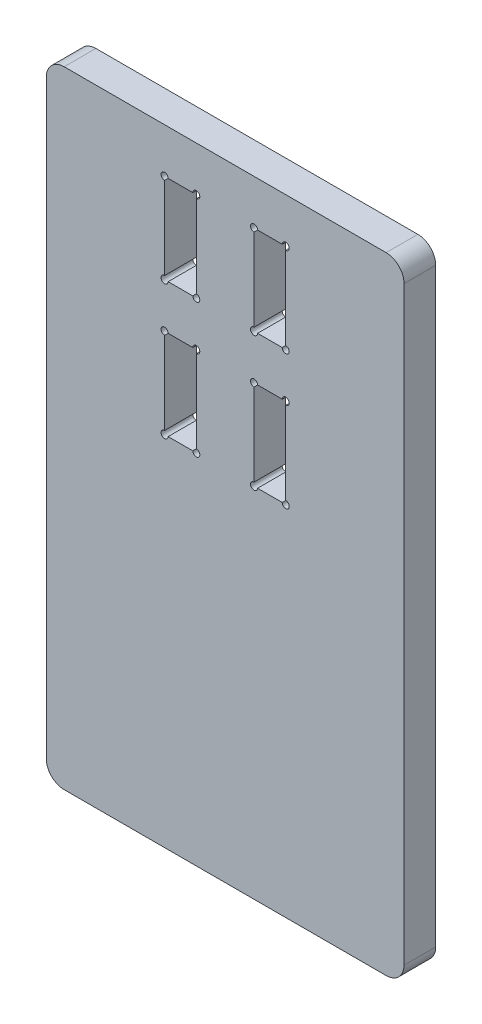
ISO-10303-21;
HEADER;
FILE_DESCRIPTION(('STEP AP214'),'2;1');
FILE_NAME('part.step','',(''),(''),'','','');
FILE_SCHEMA(('AUTOMOTIVE_DESIGN { 1 0 10303 214 1 1 1 1 }'));
ENDSEC;
DATA;
#1=APPLICATION_CONTEXT('core data for automotive mechanical design processes');
#2=APPLICATION_PROTOCOL_DEFINITION('international standard','automotive_design',2000,#1);
#3=PRODUCT_CONTEXT('',#1,'mechanical');
#4=PRODUCT('Part','Part','',(#3));
#5=PRODUCT_RELATED_PRODUCT_CATEGORY('part','',(#4));
#6=PRODUCT_DEFINITION_FORMATION('','',#4);
#7=PRODUCT_DEFINITION_CONTEXT('part definition',#1,'design');
#8=PRODUCT_DEFINITION('design','',#6,#7);
#9=PRODUCT_DEFINITION_SHAPE('','',#8);
#10=(LENGTH_UNIT() NAMED_UNIT(*) SI_UNIT(.MILLI.,.METRE.));
#11=(NAMED_UNIT(*) PLANE_ANGLE_UNIT() SI_UNIT($,.RADIAN.));
#12=(NAMED_UNIT(*) SI_UNIT($,.STERADIAN.) SOLID_ANGLE_UNIT());
#13=UNCERTAINTY_MEASURE_WITH_UNIT(LENGTH_MEASURE(1.E-05),#10,'distance_accuracy_value','');
#14=(GEOMETRIC_REPRESENTATION_CONTEXT(3) GLOBAL_UNCERTAINTY_ASSIGNED_CONTEXT((#13)) GLOBAL_UNIT_ASSIGNED_CONTEXT((#10,
#11,#12)) REPRESENTATION_CONTEXT('',''));
#15=CARTESIAN_POINT('',(0.,0.,0.));
#16=DIRECTION('',(0.,0.,1.));
#17=DIRECTION('',(1.,0.,0.));
#18=AXIS2_PLACEMENT_3D('',#15,#16,#17);
#19=CARTESIAN_POINT('',(0.,82.5500000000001,4.5));
#20=DIRECTION('',(0.,-1.,0.));
#21=DIRECTION('',(0.,0.,-1.));
#22=AXIS2_PLACEMENT_3D('',#19,#20,#21);
#23=PLANE('',#22);
#24=DIRECTION('',(-1.,0.,0.));
#25=VECTOR('',#24,1.);
#26=CARTESIAN_POINT('',(0.,82.5500000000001,0.));
#27=LINE('',#26,#25);
#28=CARTESIAN_POINT('',(20.8,82.5500000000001,0.));
#29=VERTEX_POINT('',#28);
#30=CARTESIAN_POINT('',(17.3,82.5500000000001,0.));
#31=VERTEX_POINT('',#30);
#32=EDGE_CURVE('E484',#29,#31,#27,.T.);
#33=ORIENTED_EDGE('',*,*,#32,.F.);
#34=DIRECTION('',(0.,0.,-1.));
#35=VECTOR('',#34,1.);
#36=CARTESIAN_POINT('',(20.8,82.5500000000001,4.5));
#37=LINE('',#36,#35);
#38=CARTESIAN_POINT('',(20.8,82.5500000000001,4.5));
#39=VERTEX_POINT('',#38);
#40=EDGE_CURVE('E524',#39,#29,#37,.T.);
#41=ORIENTED_EDGE('',*,*,#40,.F.);
#42=DIRECTION('',(-1.,0.,0.));
#43=VECTOR('',#42,1.);
#44=CARTESIAN_POINT('',(0.,82.5500000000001,4.5));
#45=LINE('',#44,#43);
#46=CARTESIAN_POINT('',(17.3,82.5500000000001,4.5));
#47=VERTEX_POINT('',#46);
#48=EDGE_CURVE('E384',#39,#47,#45,.T.);
#49=ORIENTED_EDGE('',*,*,#48,.T.);
#50=DIRECTION('',(0.,0.,-1.));
#51=VECTOR('',#50,1.);
#52=CARTESIAN_POINT('',(17.3,82.5500000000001,4.5));
#53=LINE('',#52,#51);
#54=EDGE_CURVE('E507',#47,#31,#53,.T.);
#55=ORIENTED_EDGE('',*,*,#54,.T.);
#56=EDGE_LOOP('',(#33,#41,#49,#55));
#57=FACE_BOUND('',#56,.T.);
#58=ADVANCED_FACE('F35',(#57),#23,.T.);
#59=CARTESIAN_POINT('',(21.3,82.5500000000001,4.5));
#60=DIRECTION('',(0.,0.,-1.));
#61=DIRECTION('',(-1.,0.,0.));
#62=AXIS2_PLACEMENT_3D('',#59,#60,#61);
#63=CYLINDRICAL_SURFACE('',#62,0.500000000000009);
#64=CARTESIAN_POINT('',(21.3,82.5500000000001,0.));
#65=DIRECTION('',(0.,0.,1.));
#66=DIRECTION('',(1.,0.,0.));
#67=AXIS2_PLACEMENT_3D('',#64,#65,#66);
#68=CIRCLE('',#67,0.500000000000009);
#69=CARTESIAN_POINT('',(21.3,82.0500000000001,0.));
#70=VERTEX_POINT('',#69);
#71=EDGE_CURVE('E487',#29,#70,#68,.F.);
#72=ORIENTED_EDGE('',*,*,#71,.T.);
#73=DIRECTION('',(0.,0.,-1.));
#74=VECTOR('',#73,1.);
#75=CARTESIAN_POINT('',(21.3,82.0500000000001,4.5));
#76=LINE('',#75,#74);
#77=CARTESIAN_POINT('',(21.3,82.0500000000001,4.5));
#78=VERTEX_POINT('',#77);
#79=EDGE_CURVE('E521',#78,#70,#76,.T.);
#80=ORIENTED_EDGE('',*,*,#79,.F.);
#81=CARTESIAN_POINT('',(21.3,82.5500000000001,4.5));
#82=DIRECTION('',(0.,0.,1.));
#83=DIRECTION('',(1.,0.,0.));
#84=AXIS2_PLACEMENT_3D('',#81,#82,#83);
#85=CIRCLE('',#84,0.500000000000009);
#86=EDGE_CURVE('E387',#39,#78,#85,.F.);
#87=ORIENTED_EDGE('',*,*,#86,.F.);
#88=ORIENTED_EDGE('',*,*,#40,.T.);
#89=EDGE_LOOP('',(#72,#80,#87,#88));
#90=FACE_BOUND('',#89,.T.);
#91=ADVANCED_FACE('F643',(#90),#63,.F.);
#92=CARTESIAN_POINT('',(21.3,0.,4.5));
#93=DIRECTION('',(1.,0.,0.));
#94=DIRECTION('',(0.,1.,0.));
#95=AXIS2_PLACEMENT_3D('',#92,#93,#94);
#96=PLANE('',#95);
#97=DIRECTION('',(0.,-1.,0.));
#98=VECTOR('',#97,1.);
#99=CARTESIAN_POINT('',(21.3,0.,0.));
#100=LINE('',#99,#98);
#101=CARTESIAN_POINT('',(21.3,70.3500000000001,0.));
#102=VERTEX_POINT('',#101);
#103=EDGE_CURVE('E490',#70,#102,#100,.T.);
#104=ORIENTED_EDGE('',*,*,#103,.T.);
#105=DIRECTION('',(0.,0.,-1.));
#106=VECTOR('',#105,1.);
#107=CARTESIAN_POINT('',(21.3,70.3500000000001,4.5));
#108=LINE('',#107,#106);
#109=CARTESIAN_POINT('',(21.3,70.3500000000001,4.5));
#110=VERTEX_POINT('',#109);
#111=EDGE_CURVE('E519',#110,#102,#108,.T.);
#112=ORIENTED_EDGE('',*,*,#111,.F.);
#113=DIRECTION('',(0.,-1.,0.));
#114=VECTOR('',#113,1.);
#115=CARTESIAN_POINT('',(21.3,0.,4.5));
#116=LINE('',#115,#114);
#117=EDGE_CURVE('E390',#78,#110,#116,.T.);
#118=ORIENTED_EDGE('',*,*,#117,.F.);
#119=ORIENTED_EDGE('',*,*,#79,.T.);
#120=EDGE_LOOP('',(#104,#112,#118,#119));
#121=FACE_BOUND('',#120,.T.);
#122=ADVANCED_FACE('F649',(#121),#96,.F.);
#123=CARTESIAN_POINT('',(21.3,69.8500000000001,4.5));
#124=DIRECTION('',(0.,0.,-1.));
#125=DIRECTION('',(-1.,0.,0.));
#126=AXIS2_PLACEMENT_3D('',#123,#124,#125);
#127=CYLINDRICAL_SURFACE('',#126,0.500000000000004);
#128=CARTESIAN_POINT('',(21.3,69.8500000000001,0.));
#129=DIRECTION('',(0.,0.,1.));
#130=DIRECTION('',(1.,0.,0.));
#131=AXIS2_PLACEMENT_3D('',#128,#129,#130);
#132=CIRCLE('',#131,0.500000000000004);
#133=CARTESIAN_POINT('',(20.8,69.8500000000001,0.));
#134=VERTEX_POINT('',#133);
#135=EDGE_CURVE('E493',#134,#102,#132,.T.);
#136=ORIENTED_EDGE('',*,*,#135,.F.);
#137=DIRECTION('',(0.,0.,-1.));
#138=VECTOR('',#137,1.);
#139=CARTESIAN_POINT('',(20.8,69.8500000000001,4.5));
#140=LINE('',#139,#138);
#141=CARTESIAN_POINT('',(20.8,69.8500000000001,4.5));
#142=VERTEX_POINT('',#141);
#143=EDGE_CURVE('E517',#142,#134,#140,.T.);
#144=ORIENTED_EDGE('',*,*,#143,.F.);
#145=CARTESIAN_POINT('',(21.3,69.8500000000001,4.5));
#146=DIRECTION('',(0.,0.,1.));
#147=DIRECTION('',(1.,0.,0.));
#148=AXIS2_PLACEMENT_3D('',#145,#146,#147);
#149=CIRCLE('',#148,0.500000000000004);
#150=EDGE_CURVE('E392',#142,#110,#149,.T.);
#151=ORIENTED_EDGE('',*,*,#150,.T.);
#152=ORIENTED_EDGE('',*,*,#111,.T.);
#153=EDGE_LOOP('',(#136,#144,#151,#152));
#154=FACE_BOUND('',#153,.T.);
#155=ADVANCED_FACE('F1005',(#154),#127,.F.);
#156=CARTESIAN_POINT('',(0.,69.8500000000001,4.5));
#157=DIRECTION('',(0.,-1.,0.));
#158=DIRECTION('',(0.,0.,-1.));
#159=AXIS2_PLACEMENT_3D('',#156,#157,#158);
#160=PLANE('',#159);
#161=DIRECTION('',(-1.,0.,0.));
#162=VECTOR('',#161,1.);
#163=CARTESIAN_POINT('',(0.,69.8500000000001,0.));
#164=LINE('',#163,#162);
#165=CARTESIAN_POINT('',(17.3,69.8500000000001,0.));
#166=VERTEX_POINT('',#165);
#167=EDGE_CURVE('E496',#134,#166,#164,.T.);
#168=ORIENTED_EDGE('',*,*,#167,.T.);
#169=DIRECTION('',(0.,0.,-1.));
#170=VECTOR('',#169,1.);
#171=CARTESIAN_POINT('',(17.3,69.8500000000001,4.5));
#172=LINE('',#171,#170);
#173=CARTESIAN_POINT('',(17.3,69.8500000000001,4.5));
#174=VERTEX_POINT('',#173);
#175=EDGE_CURVE('E514',#174,#166,#172,.T.);
#176=ORIENTED_EDGE('',*,*,#175,.F.);
#177=DIRECTION('',(-1.,0.,0.));
#178=VECTOR('',#177,1.);
#179=CARTESIAN_POINT('',(0.,69.8500000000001,4.5));
#180=LINE('',#179,#178);
#181=EDGE_CURVE('E395',#142,#174,#180,.T.);
#182=ORIENTED_EDGE('',*,*,#181,.F.);
#183=ORIENTED_EDGE('',*,*,#143,.T.);
#184=EDGE_LOOP('',(#168,#176,#182,#183));
#185=FACE_BOUND('',#184,.T.);
#186=ADVANCED_FACE('F995',(#185),#160,.F.);
#187=CARTESIAN_POINT('',(16.8,69.8500000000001,4.5));
#188=DIRECTION('',(0.,0.,-1.));
#189=DIRECTION('',(-1.,0.,0.));
#190=AXIS2_PLACEMENT_3D('',#187,#188,#189);
#191=CYLINDRICAL_SURFACE('',#190,0.500000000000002);
#192=CARTESIAN_POINT('',(16.8,69.8500000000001,0.));
#193=DIRECTION('',(0.,0.,1.));
#194=DIRECTION('',(1.,0.,0.));
#195=AXIS2_PLACEMENT_3D('',#192,#193,#194);
#196=CIRCLE('',#195,0.500000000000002);
#197=CARTESIAN_POINT('',(16.8,70.3500000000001,0.));
#198=VERTEX_POINT('',#197);
#199=EDGE_CURVE('E499',#166,#198,#196,.F.);
#200=ORIENTED_EDGE('',*,*,#199,.T.);
#201=DIRECTION('',(0.,0.,-1.));
#202=VECTOR('',#201,1.);
#203=CARTESIAN_POINT('',(16.8,70.3500000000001,4.5));
#204=LINE('',#203,#202);
#205=CARTESIAN_POINT('',(16.8,70.3500000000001,4.5));
#206=VERTEX_POINT('',#205);
#207=EDGE_CURVE('E512',#206,#198,#204,.T.);
#208=ORIENTED_EDGE('',*,*,#207,.F.);
#209=CARTESIAN_POINT('',(16.8,69.8500000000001,4.5));
#210=DIRECTION('',(0.,0.,1.));
#211=DIRECTION('',(1.,0.,0.));
#212=AXIS2_PLACEMENT_3D('',#209,#210,#211);
#213=CIRCLE('',#212,0.500000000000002);
#214=EDGE_CURVE('E398',#174,#206,#213,.F.);
#215=ORIENTED_EDGE('',*,*,#214,.F.);
#216=ORIENTED_EDGE('',*,*,#175,.T.);
#217=EDGE_LOOP('',(#200,#208,#215,#216));
#218=FACE_BOUND('',#217,.T.);
#219=ADVANCED_FACE('F985',(#218),#191,.F.);
#220=CARTESIAN_POINT('',(16.8,0.,4.5));
#221=DIRECTION('',(1.,0.,0.));
#222=DIRECTION('',(0.,1.,0.));
#223=AXIS2_PLACEMENT_3D('',#220,#221,#222);
#224=PLANE('',#223);
#225=DIRECTION('',(0.,-1.,0.));
#226=VECTOR('',#225,1.);
#227=CARTESIAN_POINT('',(16.8,0.,0.));
#228=LINE('',#227,#226);
#229=CARTESIAN_POINT('',(16.8,82.0500000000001,0.));
#230=VERTEX_POINT('',#229);
#231=EDGE_CURVE('E502',#230,#198,#228,.T.);
#232=ORIENTED_EDGE('',*,*,#231,.F.);
#233=DIRECTION('',(0.,0.,-1.));
#234=VECTOR('',#233,1.);
#235=CARTESIAN_POINT('',(16.8,82.0500000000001,4.5));
#236=LINE('',#235,#234);
#237=CARTESIAN_POINT('',(16.8,82.0500000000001,4.5));
#238=VERTEX_POINT('',#237);
#239=EDGE_CURVE('E509',#238,#230,#236,.T.);
#240=ORIENTED_EDGE('',*,*,#239,.F.);
#241=DIRECTION('',(0.,-1.,0.));
#242=VECTOR('',#241,1.);
#243=CARTESIAN_POINT('',(16.8,0.,4.5));
#244=LINE('',#243,#242);
#245=EDGE_CURVE('E400',#238,#206,#244,.T.);
#246=ORIENTED_EDGE('',*,*,#245,.T.);
#247=ORIENTED_EDGE('',*,*,#207,.T.);
#248=EDGE_LOOP('',(#232,#240,#246,#247));
#249=FACE_BOUND('',#248,.T.);
#250=ADVANCED_FACE('F689',(#249),#224,.T.);
#251=CARTESIAN_POINT('',(-1.95831005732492E-13,63.4999999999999,4.5));
#252=DIRECTION('',(0.,-1.,0.));
#253=DIRECTION('',(1.,0.,0.));
#254=AXIS2_PLACEMENT_3D('',#251,#252,#253);
#255=PLANE('',#254);
#256=DIRECTION('',(-1.,0.,0.));
#257=VECTOR('',#256,1.);
#258=CARTESIAN_POINT('',(-1.95831005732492E-13,63.4999999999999,0.));
#259=LINE('',#258,#257);
#260=CARTESIAN_POINT('',(20.8,63.4999999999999,0.));
#261=VERTEX_POINT('',#260);
#262=CARTESIAN_POINT('',(17.3,63.4999999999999,0.));
#263=VERTEX_POINT('',#262);
#264=EDGE_CURVE('E460',#261,#263,#259,.T.);
#265=ORIENTED_EDGE('',*,*,#264,.F.);
#266=DIRECTION('',(0.,0.,-1.));
#267=VECTOR('',#266,1.);
#268=CARTESIAN_POINT('',(20.8,63.4999999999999,4.5));
#269=LINE('',#268,#267);
#270=CARTESIAN_POINT('',(20.8,63.4999999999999,4.5));
#271=VERTEX_POINT('',#270);
#272=EDGE_CURVE('E510',#271,#261,#269,.T.);
#273=ORIENTED_EDGE('',*,*,#272,.F.);
#274=DIRECTION('',(-1.,0.,0.));
#275=VECTOR('',#274,1.);
#276=CARTESIAN_POINT('',(-1.95831005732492E-13,63.4999999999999,4.5));
#277=LINE('',#276,#275);
#278=CARTESIAN_POINT('',(17.3,63.4999999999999,4.5));
#279=VERTEX_POINT('',#278);
#280=EDGE_CURVE('E362',#271,#279,#277,.T.);
#281=ORIENTED_EDGE('',*,*,#280,.T.);
#282=DIRECTION('',(0.,0.,-1.));
#283=VECTOR('',#282,1.);
#284=CARTESIAN_POINT('',(17.3,63.4999999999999,4.5));
#285=LINE('',#284,#283);
#286=EDGE_CURVE('E527',#279,#263,#285,.T.);
#287=ORIENTED_EDGE('',*,*,#286,.T.);
#288=EDGE_LOOP('',(#265,#273,#281,#287));
#289=FACE_BOUND('',#288,.T.);
#290=ADVANCED_FACE('F685',(#289),#255,.T.);
#291=CARTESIAN_POINT('',(21.3,63.4999999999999,4.5));
#292=DIRECTION('',(0.,0.,-1.));
#293=DIRECTION('',(-1.,0.,0.));
#294=AXIS2_PLACEMENT_3D('',#291,#292,#293);
#295=CYLINDRICAL_SURFACE('',#294,0.500000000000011);
#296=CARTESIAN_POINT('',(21.3,63.4999999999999,0.));
#297=DIRECTION('',(0.,0.,1.));
#298=DIRECTION('',(1.,0.,0.));
#299=AXIS2_PLACEMENT_3D('',#296,#297,#298);
#300=CIRCLE('',#299,0.500000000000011);
#301=CARTESIAN_POINT('',(21.3,62.9999999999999,0.));
#302=VERTEX_POINT('',#301);
#303=EDGE_CURVE('E463',#261,#302,#300,.F.);
#304=ORIENTED_EDGE('',*,*,#303,.T.);
#305=DIRECTION('',(0.,0.,-1.));
#306=VECTOR('',#305,1.);
#307=CARTESIAN_POINT('',(21.3,62.9999999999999,4.5));
#308=LINE('',#307,#306);
#309=CARTESIAN_POINT('',(21.3,62.9999999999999,4.5));
#310=VERTEX_POINT('',#309);
#311=EDGE_CURVE('E542',#310,#302,#308,.T.);
#312=ORIENTED_EDGE('',*,*,#311,.F.);
#313=CARTESIAN_POINT('',(21.3,63.4999999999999,4.5));
#314=DIRECTION('',(0.,0.,1.));
#315=DIRECTION('',(1.,0.,0.));
#316=AXIS2_PLACEMENT_3D('',#313,#314,#315);
#317=CIRCLE('',#316,0.500000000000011);
#318=EDGE_CURVE('E365',#271,#310,#317,.F.);
#319=ORIENTED_EDGE('',*,*,#318,.F.);
#320=ORIENTED_EDGE('',*,*,#272,.T.);
#321=EDGE_LOOP('',(#304,#312,#319,#320));
#322=FACE_BOUND('',#321,.T.);
#323=ADVANCED_FACE('F681',(#322),#295,.F.);
#324=CARTESIAN_POINT('',(21.3,0.,4.5));
#325=DIRECTION('',(-1.,0.,0.));
#326=DIRECTION('',(0.,0.,1.));
#327=AXIS2_PLACEMENT_3D('',#324,#325,#326);
#328=PLANE('',#327);
#329=DIRECTION('',(0.,1.,0.));
#330=VECTOR('',#329,1.);
#331=CARTESIAN_POINT('',(21.3,0.,0.));
#332=LINE('',#331,#330);
#333=CARTESIAN_POINT('',(21.3,51.2999999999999,0.));
#334=VERTEX_POINT('',#333);
#335=EDGE_CURVE('E466',#334,#302,#332,.T.);
#336=ORIENTED_EDGE('',*,*,#335,.F.);
#337=DIRECTION('',(0.,0.,-1.));
#338=VECTOR('',#337,1.);
#339=CARTESIAN_POINT('',(21.3,51.2999999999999,4.5));
#340=LINE('',#339,#338);
#341=CARTESIAN_POINT('',(21.3,51.2999999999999,4.5));
#342=VERTEX_POINT('',#341);
#343=EDGE_CURVE('E540',#342,#334,#340,.T.);
#344=ORIENTED_EDGE('',*,*,#343,.F.);
#345=DIRECTION('',(0.,1.,0.));
#346=VECTOR('',#345,1.);
#347=CARTESIAN_POINT('',(21.3,0.,4.5));
#348=LINE('',#347,#346);
#349=EDGE_CURVE('E367',#342,#310,#348,.T.);
#350=ORIENTED_EDGE('',*,*,#349,.T.);
#351=ORIENTED_EDGE('',*,*,#311,.T.);
#352=EDGE_LOOP('',(#336,#344,#350,#351));
#353=FACE_BOUND('',#352,.T.);
#354=ADVANCED_FACE('F677',(#353),#328,.T.);
#355=CARTESIAN_POINT('',(21.3,50.7999999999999,4.5));
#356=DIRECTION('',(0.,0.,-1.));
#357=DIRECTION('',(-1.,0.,0.));
#358=AXIS2_PLACEMENT_3D('',#355,#356,#357);
#359=CYLINDRICAL_SURFACE('',#358,0.5);
#360=CARTESIAN_POINT('',(21.3,50.7999999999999,0.));
#361=DIRECTION('',(0.,0.,1.));
#362=DIRECTION('',(1.,0.,0.));
#363=AXIS2_PLACEMENT_3D('',#360,#361,#362);
#364=CIRCLE('',#363,0.5);
#365=CARTESIAN_POINT('',(20.8,50.7999999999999,0.));
#366=VERTEX_POINT('',#365);
#367=EDGE_CURVE('E469',#366,#334,#364,.T.);
#368=ORIENTED_EDGE('',*,*,#367,.F.);
#369=DIRECTION('',(0.,0.,-1.));
#370=VECTOR('',#369,1.);
#371=CARTESIAN_POINT('',(20.8,50.7999999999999,4.5));
#372=LINE('',#371,#370);
#373=CARTESIAN_POINT('',(20.8,50.7999999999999,4.5));
#374=VERTEX_POINT('',#373);
#375=EDGE_CURVE('E538',#374,#366,#372,.T.);
#376=ORIENTED_EDGE('',*,*,#375,.F.);
#377=CARTESIAN_POINT('',(21.3,50.7999999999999,4.5));
#378=DIRECTION('',(0.,0.,1.));
#379=DIRECTION('',(1.,0.,0.));
#380=AXIS2_PLACEMENT_3D('',#377,#378,#379);
#381=CIRCLE('',#380,0.5);
#382=EDGE_CURVE('E370',#374,#342,#381,.T.);
#383=ORIENTED_EDGE('',*,*,#382,.T.);
#384=ORIENTED_EDGE('',*,*,#343,.T.);
#385=EDGE_LOOP('',(#368,#376,#383,#384));
#386=FACE_BOUND('',#385,.T.);
#387=ADVANCED_FACE('F673',(#386),#359,.F.);
#388=CARTESIAN_POINT('',(0.,50.7999999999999,4.5));
#389=DIRECTION('',(0.,-1.,0.));
#390=DIRECTION('',(0.,0.,-1.));
#391=AXIS2_PLACEMENT_3D('',#388,#389,#390);
#392=PLANE('',#391);
#393=DIRECTION('',(-1.,0.,0.));
#394=VECTOR('',#393,1.);
#395=CARTESIAN_POINT('',(0.,50.7999999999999,0.));
#396=LINE('',#395,#394);
#397=CARTESIAN_POINT('',(17.3,50.7999999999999,0.));
#398=VERTEX_POINT('',#397);
#399=EDGE_CURVE('E472',#366,#398,#396,.T.);
#400=ORIENTED_EDGE('',*,*,#399,.T.);
#401=DIRECTION('',(0.,0.,-1.));
#402=VECTOR('',#401,1.);
#403=CARTESIAN_POINT('',(17.3,50.7999999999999,4.5));
#404=LINE('',#403,#402);
#405=CARTESIAN_POINT('',(17.3,50.7999999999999,4.5));
#406=VERTEX_POINT('',#405);
#407=EDGE_CURVE('E535',#406,#398,#404,.T.);
#408=ORIENTED_EDGE('',*,*,#407,.F.);
#409=DIRECTION('',(-1.,0.,0.));
#410=VECTOR('',#409,1.);
#411=CARTESIAN_POINT('',(0.,50.7999999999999,4.5));
#412=LINE('',#411,#410);
#413=EDGE_CURVE('E373',#374,#406,#412,.T.);
#414=ORIENTED_EDGE('',*,*,#413,.F.);
#415=ORIENTED_EDGE('',*,*,#375,.T.);
#416=EDGE_LOOP('',(#400,#408,#414,#415));
#417=FACE_BOUND('',#416,.T.);
#418=ADVANCED_FACE('F669',(#417),#392,.F.);
#419=CARTESIAN_POINT('',(16.8,50.7999999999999,4.5));
#420=DIRECTION('',(0.,0.,-1.));
#421=DIRECTION('',(-1.,0.,0.));
#422=AXIS2_PLACEMENT_3D('',#419,#420,#421);
#423=CYLINDRICAL_SURFACE('',#422,0.499999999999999);
#424=CARTESIAN_POINT('',(16.8,50.7999999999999,0.));
#425=DIRECTION('',(0.,0.,1.));
#426=DIRECTION('',(1.,0.,0.));
#427=AXIS2_PLACEMENT_3D('',#424,#425,#426);
#428=CIRCLE('',#427,0.499999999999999);
#429=CARTESIAN_POINT('',(16.8,51.2999999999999,0.));
#430=VERTEX_POINT('',#429);
#431=EDGE_CURVE('E475',#398,#430,#428,.F.);
#432=ORIENTED_EDGE('',*,*,#431,.T.);
#433=DIRECTION('',(0.,0.,-1.));
#434=VECTOR('',#433,1.);
#435=CARTESIAN_POINT('',(16.8,51.2999999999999,4.5));
#436=LINE('',#435,#434);
#437=CARTESIAN_POINT('',(16.8,51.2999999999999,4.5));
#438=VERTEX_POINT('',#437);
#439=EDGE_CURVE('E532',#438,#430,#436,.T.);
#440=ORIENTED_EDGE('',*,*,#439,.F.);
#441=CARTESIAN_POINT('',(16.8,50.7999999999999,4.5));
#442=DIRECTION('',(0.,0.,1.));
#443=DIRECTION('',(1.,0.,0.));
#444=AXIS2_PLACEMENT_3D('',#441,#442,#443);
#445=CIRCLE('',#444,0.499999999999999);
#446=EDGE_CURVE('E376',#406,#438,#445,.F.);
#447=ORIENTED_EDGE('',*,*,#446,.F.);
#448=ORIENTED_EDGE('',*,*,#407,.T.);
#449=EDGE_LOOP('',(#432,#440,#447,#448));
#450=FACE_BOUND('',#449,.T.);
#451=ADVANCED_FACE('F665',(#450),#423,.F.);
#452=CARTESIAN_POINT('',(16.8,0.,4.5));
#453=DIRECTION('',(-1.,0.,0.));
#454=DIRECTION('',(0.,0.,1.));
#455=AXIS2_PLACEMENT_3D('',#452,#453,#454);
#456=PLANE('',#455);
#457=DIRECTION('',(0.,1.,0.));
#458=VECTOR('',#457,1.);
#459=CARTESIAN_POINT('',(16.8,0.,0.));
#460=LINE('',#459,#458);
#461=CARTESIAN_POINT('',(16.8,62.9999999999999,0.));
#462=VERTEX_POINT('',#461);
#463=EDGE_CURVE('E478',#430,#462,#460,.T.);
#464=ORIENTED_EDGE('',*,*,#463,.T.);
#465=DIRECTION('',(0.,0.,-1.));
#466=VECTOR('',#465,1.);
#467=CARTESIAN_POINT('',(16.8,62.9999999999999,4.5));
#468=LINE('',#467,#466);
#469=CARTESIAN_POINT('',(16.8,62.9999999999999,4.5));
#470=VERTEX_POINT('',#469);
#471=EDGE_CURVE('E529',#470,#462,#468,.T.);
#472=ORIENTED_EDGE('',*,*,#471,.F.);
#473=DIRECTION('',(0.,1.,0.));
#474=VECTOR('',#473,1.);
#475=CARTESIAN_POINT('',(16.8,0.,4.5));
#476=LINE('',#475,#474);
#477=EDGE_CURVE('E379',#438,#470,#476,.T.);
#478=ORIENTED_EDGE('',*,*,#477,.F.);
#479=ORIENTED_EDGE('',*,*,#439,.T.);
#480=EDGE_LOOP('',(#464,#472,#478,#479));
#481=FACE_BOUND('',#480,.T.);
#482=ADVANCED_FACE('F661',(#481),#456,.F.);
#483=CARTESIAN_POINT('',(0.,50.8,4.5));
#484=DIRECTION('',(0.,-1.,0.));
#485=DIRECTION('',(0.,0.,-1.));
#486=AXIS2_PLACEMENT_3D('',#483,#484,#485);
#487=PLANE('',#486);
#488=DIRECTION('',(-1.,0.,0.));
#489=VECTOR('',#488,1.);
#490=CARTESIAN_POINT('',(0.,50.8,0.));
#491=LINE('',#490,#489);
#492=CARTESIAN_POINT('',(33.5,50.8,0.));
#493=VERTEX_POINT('',#492);
#494=CARTESIAN_POINT('',(30.,50.8,0.));
#495=VERTEX_POINT('',#494);
#496=EDGE_CURVE('E437',#493,#495,#491,.T.);
#497=ORIENTED_EDGE('',*,*,#496,.T.);
#498=DIRECTION('',(0.,0.,-1.));
#499=VECTOR('',#498,1.);
#500=CARTESIAN_POINT('',(30.,50.8,4.5));
#501=LINE('',#500,#499);
#502=CARTESIAN_POINT('',(30.,50.8,4.5));
#503=VERTEX_POINT('',#502);
#504=EDGE_CURVE('E530',#503,#495,#501,.T.);
#505=ORIENTED_EDGE('',*,*,#504,.F.);
#506=DIRECTION('',(-1.,0.,0.));
#507=VECTOR('',#506,1.);
#508=CARTESIAN_POINT('',(0.,50.8,4.5));
#509=LINE('',#508,#507);
#510=CARTESIAN_POINT('',(33.5,50.8,4.5));
#511=VERTEX_POINT('',#510);
#512=EDGE_CURVE('E341',#511,#503,#509,.T.);
#513=ORIENTED_EDGE('',*,*,#512,.F.);
#514=DIRECTION('',(0.,0.,-1.));
#515=VECTOR('',#514,1.);
#516=CARTESIAN_POINT('',(33.5,50.8,4.5));
#517=LINE('',#516,#515);
#518=EDGE_CURVE('E303',#511,#493,#517,.T.);
#519=ORIENTED_EDGE('',*,*,#518,.T.);
#520=EDGE_LOOP('',(#497,#505,#513,#519));
#521=FACE_BOUND('',#520,.T.);
#522=ADVANCED_FACE('F664',(#521),#487,.F.);
#523=CARTESIAN_POINT('',(29.5,50.8,4.5));
#524=DIRECTION('',(0.,0.,-1.));
#525=DIRECTION('',(-1.,0.,0.));
#526=AXIS2_PLACEMENT_3D('',#523,#524,#525);
#527=CYLINDRICAL_SURFACE('',#526,0.499999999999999);
#528=CARTESIAN_POINT('',(29.5,50.8,0.));
#529=DIRECTION('',(0.,0.,1.));
#530=DIRECTION('',(1.,0.,0.));
#531=AXIS2_PLACEMENT_3D('',#528,#529,#530);
#532=CIRCLE('',#531,0.499999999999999);
#533=CARTESIAN_POINT('',(29.5,51.3,0.));
#534=VERTEX_POINT('',#533);
#535=EDGE_CURVE('E440',#495,#534,#532,.F.);
#536=ORIENTED_EDGE('',*,*,#535,.T.);
#537=DIRECTION('',(0.,0.,-1.));
#538=VECTOR('',#537,1.);
#539=CARTESIAN_POINT('',(29.5,51.3,4.5));
#540=LINE('',#539,#538);
#541=CARTESIAN_POINT('',(29.5,51.3,4.5));
#542=VERTEX_POINT('',#541);
#543=EDGE_CURVE('E556',#542,#534,#540,.T.);
#544=ORIENTED_EDGE('',*,*,#543,.F.);
#545=CARTESIAN_POINT('',(29.5,50.8,4.5));
#546=DIRECTION('',(0.,0.,1.));
#547=DIRECTION('',(1.,0.,0.));
#548=AXIS2_PLACEMENT_3D('',#545,#546,#547);
#549=CIRCLE('',#548,0.499999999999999);
#550=EDGE_CURVE('E344',#503,#542,#549,.F.);
#551=ORIENTED_EDGE('',*,*,#550,.F.);
#552=ORIENTED_EDGE('',*,*,#504,.T.);
#553=EDGE_LOOP('',(#536,#544,#551,#552));
#554=FACE_BOUND('',#553,.T.);
#555=ADVANCED_FACE('F713',(#554),#527,.F.);
#556=CARTESIAN_POINT('',(29.5,0.,4.5));
#557=DIRECTION('',(-1.,0.,0.));
#558=DIRECTION('',(0.,0.,1.));
#559=AXIS2_PLACEMENT_3D('',#556,#557,#558);
#560=PLANE('',#559);
#561=DIRECTION('',(0.,1.,0.));
#562=VECTOR('',#561,1.);
#563=CARTESIAN_POINT('',(29.5,0.,0.));
#564=LINE('',#563,#562);
#565=CARTESIAN_POINT('',(29.5,63.,0.));
#566=VERTEX_POINT('',#565);
#567=EDGE_CURVE('E442',#534,#566,#564,.T.);
#568=ORIENTED_EDGE('',*,*,#567,.T.);
#569=DIRECTION('',(0.,0.,-1.));
#570=VECTOR('',#569,1.);
#571=CARTESIAN_POINT('',(29.5,63.,4.5));
#572=LINE('',#571,#570);
#573=CARTESIAN_POINT('',(29.5,63.,4.5));
#574=VERTEX_POINT('',#573);
#575=EDGE_CURVE('E554',#574,#566,#572,.T.);
#576=ORIENTED_EDGE('',*,*,#575,.F.);
#577=DIRECTION('',(0.,1.,0.));
#578=VECTOR('',#577,1.);
#579=CARTESIAN_POINT('',(29.5,0.,4.5));
#580=LINE('',#579,#578);
#581=EDGE_CURVE('E346',#542,#574,#580,.T.);
#582=ORIENTED_EDGE('',*,*,#581,.F.);
#583=ORIENTED_EDGE('',*,*,#543,.T.);
#584=EDGE_LOOP('',(#568,#576,#582,#583));
#585=FACE_BOUND('',#584,.T.);
#586=ADVANCED_FACE('F709',(#585),#560,.F.);
#587=CARTESIAN_POINT('',(29.5,63.5,4.5));
#588=DIRECTION('',(0.,0.,-1.));
#589=DIRECTION('',(-1.,0.,0.));
#590=AXIS2_PLACEMENT_3D('',#587,#588,#589);
#591=CYLINDRICAL_SURFACE('',#590,0.500000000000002);
#592=CARTESIAN_POINT('',(29.5,63.5,0.));
#593=DIRECTION('',(0.,0.,1.));
#594=DIRECTION('',(1.,0.,0.));
#595=AXIS2_PLACEMENT_3D('',#592,#593,#594);
#596=CIRCLE('',#595,0.500000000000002);
#597=CARTESIAN_POINT('',(30.,63.5,0.));
#598=VERTEX_POINT('',#597);
#599=EDGE_CURVE('E445',#598,#566,#596,.T.);
#600=ORIENTED_EDGE('',*,*,#599,.F.);
#601=DIRECTION('',(0.,0.,-1.));
#602=VECTOR('',#601,1.);
#603=CARTESIAN_POINT('',(30.,63.5,4.5));
#604=LINE('',#603,#602);
#605=CARTESIAN_POINT('',(30.,63.5,4.5));
#606=VERTEX_POINT('',#605);
#607=EDGE_CURVE('E552',#606,#598,#604,.T.);
#608=ORIENTED_EDGE('',*,*,#607,.F.);
#609=CARTESIAN_POINT('',(29.5,63.5,4.5));
#610=DIRECTION('',(0.,0.,1.));
#611=DIRECTION('',(1.,0.,0.));
#612=AXIS2_PLACEMENT_3D('',#609,#610,#611);
#613=CIRCLE('',#612,0.500000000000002);
#614=EDGE_CURVE('E348',#606,#574,#613,.T.);
#615=ORIENTED_EDGE('',*,*,#614,.T.);
#616=ORIENTED_EDGE('',*,*,#575,.T.);
#617=EDGE_LOOP('',(#600,#608,#615,#616));
#618=FACE_BOUND('',#617,.T.);
#619=ADVANCED_FACE('F705',(#618),#591,.F.);
#620=CARTESIAN_POINT('',(-1.95831005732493E-13,63.4999999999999,4.5));
#621=DIRECTION('',(0.,-1.,0.));
#622=DIRECTION('',(1.,0.,0.));
#623=AXIS2_PLACEMENT_3D('',#620,#621,#622);
#624=PLANE('',#623);
#625=DIRECTION('',(-1.,0.,0.));
#626=VECTOR('',#625,1.);
#627=CARTESIAN_POINT('',(-1.95831005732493E-13,63.4999999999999,0.));
#628=LINE('',#627,#626);
#629=CARTESIAN_POINT('',(33.5,63.5,0.));
#630=VERTEX_POINT('',#629);
#631=EDGE_CURVE('E448',#630,#598,#628,.T.);
#632=ORIENTED_EDGE('',*,*,#631,.F.);
#633=DIRECTION('',(0.,0.,-1.));
#634=VECTOR('',#633,1.);
#635=CARTESIAN_POINT('',(33.5,63.5,4.5));
#636=LINE('',#635,#634);
#637=CARTESIAN_POINT('',(33.5,63.5,4.5));
#638=VERTEX_POINT('',#637);
#639=EDGE_CURVE('E550',#638,#630,#636,.T.);
#640=ORIENTED_EDGE('',*,*,#639,.F.);
#641=DIRECTION('',(-1.,0.,0.));
#642=VECTOR('',#641,1.);
#643=CARTESIAN_POINT('',(-1.95831005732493E-13,63.4999999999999,4.5));
#644=LINE('',#643,#642);
#645=EDGE_CURVE('E351',#638,#606,#644,.T.);
#646=ORIENTED_EDGE('',*,*,#645,.T.);
#647=ORIENTED_EDGE('',*,*,#607,.T.);
#648=EDGE_LOOP('',(#632,#640,#646,#647));
#649=FACE_BOUND('',#648,.T.);
#650=ADVANCED_FACE('F701',(#649),#624,.T.);
#651=CARTESIAN_POINT('',(34.,63.5,4.5));
#652=DIRECTION('',(0.,0.,-1.));
#653=DIRECTION('',(-1.,0.,0.));
#654=AXIS2_PLACEMENT_3D('',#651,#652,#653);
#655=CYLINDRICAL_SURFACE('',#654,0.500000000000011);
#656=CARTESIAN_POINT('',(34.,63.5,0.));
#657=DIRECTION('',(0.,0.,1.));
#658=DIRECTION('',(1.,0.,0.));
#659=AXIS2_PLACEMENT_3D('',#656,#657,#658);
#660=CIRCLE('',#659,0.500000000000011);
#661=CARTESIAN_POINT('',(34.,63.,0.));
#662=VERTEX_POINT('',#661);
#663=EDGE_CURVE('E451',#630,#662,#660,.F.);
#664=ORIENTED_EDGE('',*,*,#663,.T.);
#665=DIRECTION('',(0.,0.,-1.));
#666=VECTOR('',#665,1.);
#667=CARTESIAN_POINT('',(34.,63.,4.5));
#668=LINE('',#667,#666);
#669=CARTESIAN_POINT('',(34.,63.,4.5));
#670=VERTEX_POINT('',#669);
#671=EDGE_CURVE('E548',#670,#662,#668,.T.);
#672=ORIENTED_EDGE('',*,*,#671,.F.);
#673=CARTESIAN_POINT('',(34.,63.5,4.5));
#674=DIRECTION('',(0.,0.,1.));
#675=DIRECTION('',(1.,0.,0.));
#676=AXIS2_PLACEMENT_3D('',#673,#674,#675);
#677=CIRCLE('',#676,0.500000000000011);
#678=EDGE_CURVE('E354',#638,#670,#677,.F.);
#679=ORIENTED_EDGE('',*,*,#678,.F.);
#680=ORIENTED_EDGE('',*,*,#639,.T.);
#681=EDGE_LOOP('',(#664,#672,#679,#680));
#682=FACE_BOUND('',#681,.T.);
#683=ADVANCED_FACE('F697',(#682),#655,.F.);
#684=CARTESIAN_POINT('',(34.,0.,4.5));
#685=DIRECTION('',(-1.,0.,0.));
#686=DIRECTION('',(0.,0.,1.));
#687=AXIS2_PLACEMENT_3D('',#684,#685,#686);
#688=PLANE('',#687);
#689=DIRECTION('',(0.,1.,0.));
#690=VECTOR('',#689,1.);
#691=CARTESIAN_POINT('',(34.,0.,0.));
#692=LINE('',#691,#690);
#693=CARTESIAN_POINT('',(34.,51.3,0.));
#694=VERTEX_POINT('',#693);
#695=EDGE_CURVE('E454',#694,#662,#692,.T.);
#696=ORIENTED_EDGE('',*,*,#695,.F.);
#697=DIRECTION('',(0.,0.,-1.));
#698=VECTOR('',#697,1.);
#699=CARTESIAN_POINT('',(34.,51.3,4.5));
#700=LINE('',#699,#698);
#701=CARTESIAN_POINT('',(34.,51.3,4.5));
#702=VERTEX_POINT('',#701);
#703=EDGE_CURVE('E546',#702,#694,#700,.T.);
#704=ORIENTED_EDGE('',*,*,#703,.F.);
#705=DIRECTION('',(0.,1.,0.));
#706=VECTOR('',#705,1.);
#707=CARTESIAN_POINT('',(34.,0.,4.5));
#708=LINE('',#707,#706);
#709=EDGE_CURVE('E356',#702,#670,#708,.T.);
#710=ORIENTED_EDGE('',*,*,#709,.T.);
#711=ORIENTED_EDGE('',*,*,#671,.T.);
#712=EDGE_LOOP('',(#696,#704,#710,#711));
#713=FACE_BOUND('',#712,.T.);
#714=ADVANCED_FACE('F694',(#713),#688,.T.);
#715=CARTESIAN_POINT('',(0.,0.,4.5));
#716=DIRECTION('',(-1.,0.,0.));
#717=DIRECTION('',(0.,0.,1.));
#718=AXIS2_PLACEMENT_3D('',#715,#716,#717);
#719=PLANE('',#718);
#720=DIRECTION('',(0.,1.,0.));
#721=VECTOR('',#720,1.);
#722=CARTESIAN_POINT('',(0.,0.,4.5));
#723=LINE('',#722,#721);
#724=CARTESIAN_POINT('',(0.,2.54,4.5));
#725=VERTEX_POINT('',#724);
#726=CARTESIAN_POINT('',(0.,86.36,4.5));
#727=VERTEX_POINT('',#726);
#728=EDGE_CURVE('E330',#725,#727,#723,.T.);
#729=ORIENTED_EDGE('',*,*,#728,.T.);
#730=DIRECTION('',(0.,0.,-1.));
#731=VECTOR('',#730,1.);
#732=CARTESIAN_POINT('',(0.,86.36,4.5));
#733=LINE('',#732,#731);
#734=CARTESIAN_POINT('',(0.,86.36,0.));
#735=VERTEX_POINT('',#734);
#736=EDGE_CURVE('E601',#727,#735,#733,.T.);
#737=ORIENTED_EDGE('',*,*,#736,.T.);
#738=DIRECTION('',(0.,1.,0.));
#739=VECTOR('',#738,1.);
#740=CARTESIAN_POINT('',(0.,0.,0.));
#741=LINE('',#740,#739);
#742=CARTESIAN_POINT('',(0.,2.54,0.));
#743=VERTEX_POINT('',#742);
#744=EDGE_CURVE('E426',#743,#735,#741,.T.);
#745=ORIENTED_EDGE('',*,*,#744,.F.);
#746=DIRECTION('',(0.,0.,-1.));
#747=VECTOR('',#746,1.);
#748=CARTESIAN_POINT('',(0.,2.54,4.5));
#749=LINE('',#748,#747);
#750=EDGE_CURVE('E599',#743,#725,#749,.F.);
#751=ORIENTED_EDGE('',*,*,#750,.T.);
#752=EDGE_LOOP('',(#729,#737,#745,#751));
#753=FACE_BOUND('',#752,.T.);
#754=ADVANCED_FACE('F636',(#753),#719,.T.);
#755=CARTESIAN_POINT('',(0.,0.,4.5));
#756=DIRECTION('',(0.,1.,0.));
#757=DIRECTION('',(0.,0.,1.));
#758=AXIS2_PLACEMENT_3D('',#755,#756,#757);
#759=PLANE('',#758);
#760=DIRECTION('',(1.,0.,0.));
#761=VECTOR('',#760,1.);
#762=CARTESIAN_POINT('',(0.,0.,0.));
#763=LINE('',#762,#761);
#764=CARTESIAN_POINT('',(2.54,0.,0.));
#765=VERTEX_POINT('',#764);
#766=CARTESIAN_POINT('',(48.26,0.,0.));
#767=VERTEX_POINT('',#766);
#768=EDGE_CURVE('E429',#765,#767,#763,.T.);
#769=ORIENTED_EDGE('',*,*,#768,.T.);
#770=DIRECTION('',(0.,0.,-1.));
#771=VECTOR('',#770,1.);
#772=CARTESIAN_POINT('',(48.26,0.,4.5));
#773=LINE('',#772,#771);
#774=CARTESIAN_POINT('',(48.26,0.,4.5));
#775=VERTEX_POINT('',#774);
#776=EDGE_CURVE('E11',#767,#775,#773,.F.);
#777=ORIENTED_EDGE('',*,*,#776,.T.);
#778=DIRECTION('',(1.,0.,0.));
#779=VECTOR('',#778,1.);
#780=CARTESIAN_POINT('',(0.,0.,4.5));
#781=LINE('',#780,#779);
#782=CARTESIAN_POINT('',(2.54,0.,4.5));
#783=VERTEX_POINT('',#782);
#784=EDGE_CURVE('E333',#783,#775,#781,.T.);
#785=ORIENTED_EDGE('',*,*,#784,.F.);
#786=DIRECTION('',(0.,0.,-1.));
#787=VECTOR('',#786,1.);
#788=CARTESIAN_POINT('',(2.54,0.,0.));
#789=LINE('',#788,#787);
#790=EDGE_CURVE('E43',#783,#765,#789,.T.);
#791=ORIENTED_EDGE('',*,*,#790,.T.);
#792=EDGE_LOOP('',(#769,#777,#785,#791));
#793=FACE_BOUND('',#792,.T.);
#794=ADVANCED_FACE('F606',(#793),#759,.F.);
#795=CARTESIAN_POINT('',(50.8,0.,4.5));
#796=DIRECTION('',(-1.,0.,0.));
#797=DIRECTION('',(0.,0.,1.));
#798=AXIS2_PLACEMENT_3D('',#795,#796,#797);
#799=PLANE('',#798);
#800=DIRECTION('',(0.,1.,0.));
#801=VECTOR('',#800,1.);
#802=CARTESIAN_POINT('',(50.8,0.,0.));
#803=LINE('',#802,#801);
#804=CARTESIAN_POINT('',(50.8,2.54,0.));
#805=VERTEX_POINT('',#804);
#806=CARTESIAN_POINT('',(50.8,86.36,0.));
#807=VERTEX_POINT('',#806);
#808=EDGE_CURVE('E431',#805,#807,#803,.T.);
#809=ORIENTED_EDGE('',*,*,#808,.T.);
#810=DIRECTION('',(0.,0.,-1.));
#811=VECTOR('',#810,1.);
#812=CARTESIAN_POINT('',(50.8,86.36,4.5));
#813=LINE('',#812,#811);
#814=CARTESIAN_POINT('',(50.8,86.36,4.5));
#815=VERTEX_POINT('',#814);
#816=EDGE_CURVE('E590',#807,#815,#813,.F.);
#817=ORIENTED_EDGE('',*,*,#816,.T.);
#818=DIRECTION('',(0.,1.,0.));
#819=VECTOR('',#818,1.);
#820=CARTESIAN_POINT('',(50.8,0.,4.5));
#821=LINE('',#820,#819);
#822=CARTESIAN_POINT('',(50.8,2.54,4.5));
#823=VERTEX_POINT('',#822);
#824=EDGE_CURVE('E335',#823,#815,#821,.T.);
#825=ORIENTED_EDGE('',*,*,#824,.F.);
#826=DIRECTION('',(0.,0.,-1.));
#827=VECTOR('',#826,1.);
#828=CARTESIAN_POINT('',(50.8,2.54,4.5));
#829=LINE('',#828,#827);
#830=EDGE_CURVE('E587',#823,#805,#829,.T.);
#831=ORIENTED_EDGE('',*,*,#830,.T.);
#832=EDGE_LOOP('',(#809,#817,#825,#831));
#833=FACE_BOUND('',#832,.T.);
#834=ADVANCED_FACE('F619',(#833),#799,.F.);
#835=CARTESIAN_POINT('',(29.5,82.55,4.5));
#836=DIRECTION('',(0.,0.,-1.));
#837=DIRECTION('',(-1.,0.,0.));
#838=AXIS2_PLACEMENT_3D('',#835,#836,#837);
#839=CYLINDRICAL_SURFACE('',#838,0.499999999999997);
#840=CARTESIAN_POINT('',(29.5,82.55,0.));
#841=DIRECTION('',(0.,0.,1.));
#842=DIRECTION('',(1.,0.,0.));
#843=AXIS2_PLACEMENT_3D('',#840,#841,#842);
#844=CIRCLE('',#843,0.499999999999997);
#845=CARTESIAN_POINT('',(30.,82.55,0.));
#846=VERTEX_POINT('',#845);
#847=CARTESIAN_POINT('',(29.5,82.05,0.));
#848=VERTEX_POINT('',#847);
#849=EDGE_CURVE('E298',#846,#848,#844,.T.);
#850=ORIENTED_EDGE('',*,*,#849,.F.);
#851=DIRECTION('',(0.,0.,-1.));
#852=VECTOR('',#851,1.);
#853=CARTESIAN_POINT('',(30.,82.55,4.5));
#854=LINE('',#853,#852);
#855=CARTESIAN_POINT('',(30.,82.55,4.5));
#856=VERTEX_POINT('',#855);
#857=EDGE_CURVE('E292',#856,#846,#854,.T.);
#858=ORIENTED_EDGE('',*,*,#857,.F.);
#859=CARTESIAN_POINT('',(29.5,82.55,4.5));
#860=DIRECTION('',(0.,0.,1.));
#861=DIRECTION('',(1.,0.,0.));
#862=AXIS2_PLACEMENT_3D('',#859,#860,#861);
#863=CIRCLE('',#862,0.499999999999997);
#864=CARTESIAN_POINT('',(29.5,82.05,4.5));
#865=VERTEX_POINT('',#864);
#866=EDGE_CURVE('E295',#856,#865,#863,.T.);
#867=ORIENTED_EDGE('',*,*,#866,.T.);
#868=DIRECTION('',(0.,0.,-1.));
#869=VECTOR('',#868,1.);
#870=CARTESIAN_POINT('',(29.5,82.05,4.5));
#871=LINE('',#870,#869);
#872=EDGE_CURVE('E406',#865,#848,#871,.T.);
#873=ORIENTED_EDGE('',*,*,#872,.T.);
#874=EDGE_LOOP('',(#850,#858,#867,#873));
#875=FACE_BOUND('',#874,.T.);
#876=ADVANCED_FACE('F294',(#875),#839,.F.);
#877=CARTESIAN_POINT('',(0.,82.55,4.5));
#878=DIRECTION('',(0.,-1.,0.));
#879=DIRECTION('',(0.,0.,-1.));
#880=AXIS2_PLACEMENT_3D('',#877,#878,#879);
#881=PLANE('',#880);
#882=DIRECTION('',(-1.,0.,0.));
#883=VECTOR('',#882,1.);
#884=CARTESIAN_POINT('',(0.,82.55,0.));
#885=LINE('',#884,#883);
#886=CARTESIAN_POINT('',(33.5,82.55,0.));
#887=VERTEX_POINT('',#886);
#888=EDGE_CURVE('E408',#887,#846,#885,.T.);
#889=ORIENTED_EDGE('',*,*,#888,.F.);
#890=DIRECTION('',(0.,0.,-1.));
#891=VECTOR('',#890,1.);
#892=CARTESIAN_POINT('',(33.5,82.55,4.5));
#893=LINE('',#892,#891);
#894=CARTESIAN_POINT('',(33.5,82.55,4.5));
#895=VERTEX_POINT('',#894);
#896=EDGE_CURVE('E304',#895,#887,#893,.T.);
#897=ORIENTED_EDGE('',*,*,#896,.F.);
#898=DIRECTION('',(-1.,0.,0.));
#899=VECTOR('',#898,1.);
#900=CARTESIAN_POINT('',(0.,82.55,4.5));
#901=LINE('',#900,#899);
#902=EDGE_CURVE('E309',#895,#856,#901,.T.);
#903=ORIENTED_EDGE('',*,*,#902,.T.);
#904=ORIENTED_EDGE('',*,*,#857,.T.);
#905=EDGE_LOOP('',(#889,#897,#903,#904));
#906=FACE_BOUND('',#905,.T.);
#907=ADVANCED_FACE('F314',(#906),#881,.T.);
#908=CARTESIAN_POINT('',(34.,82.55,4.5));
#909=DIRECTION('',(0.,0.,-1.));
#910=DIRECTION('',(-1.,0.,0.));
#911=AXIS2_PLACEMENT_3D('',#908,#909,#910);
#912=CYLINDRICAL_SURFACE('',#911,0.5);
#913=CARTESIAN_POINT('',(34.,82.55,0.));
#914=DIRECTION('',(0.,0.,1.));
#915=DIRECTION('',(1.,0.,0.));
#916=AXIS2_PLACEMENT_3D('',#913,#914,#915);
#917=CIRCLE('',#916,0.5);
#918=CARTESIAN_POINT('',(34.,82.05,0.));
#919=VERTEX_POINT('',#918);
#920=EDGE_CURVE('E410',#887,#919,#917,.F.);
#921=ORIENTED_EDGE('',*,*,#920,.T.);
#922=DIRECTION('',(0.,0.,-1.));
#923=VECTOR('',#922,1.);
#924=CARTESIAN_POINT('',(34.,82.05,4.5));
#925=LINE('',#924,#923);
#926=CARTESIAN_POINT('',(34.,82.05,4.5));
#927=VERTEX_POINT('',#926);
#928=EDGE_CURVE('E571',#927,#919,#925,.T.);
#929=ORIENTED_EDGE('',*,*,#928,.F.);
#930=CARTESIAN_POINT('',(34.,82.55,4.5));
#931=DIRECTION('',(0.,0.,1.));
#932=DIRECTION('',(1.,0.,0.));
#933=AXIS2_PLACEMENT_3D('',#930,#931,#932);
#934=CIRCLE('',#933,0.5);
#935=EDGE_CURVE('E316',#895,#927,#934,.F.);
#936=ORIENTED_EDGE('',*,*,#935,.F.);
#937=ORIENTED_EDGE('',*,*,#896,.T.);
#938=EDGE_LOOP('',(#921,#929,#936,#937));
#939=FACE_BOUND('',#938,.T.);
#940=ADVANCED_FACE('F748',(#939),#912,.F.);
#941=CARTESIAN_POINT('',(34.,0.,4.5));
#942=DIRECTION('',(1.,0.,0.));
#943=DIRECTION('',(0.,1.,0.));
#944=AXIS2_PLACEMENT_3D('',#941,#942,#943);
#945=PLANE('',#944);
#946=DIRECTION('',(0.,-1.,0.));
#947=VECTOR('',#946,1.);
#948=CARTESIAN_POINT('',(34.,0.,0.));
#949=LINE('',#948,#947);
#950=CARTESIAN_POINT('',(34.,70.35,0.));
#951=VERTEX_POINT('',#950);
#952=EDGE_CURVE('E412',#919,#951,#949,.T.);
#953=ORIENTED_EDGE('',*,*,#952,.T.);
#954=DIRECTION('',(0.,0.,-1.));
#955=VECTOR('',#954,1.);
#956=CARTESIAN_POINT('',(34.,70.35,4.5));
#957=LINE('',#956,#955);
#958=CARTESIAN_POINT('',(34.,70.35,4.5));
#959=VERTEX_POINT('',#958);
#960=EDGE_CURVE('E569',#959,#951,#957,.T.);
#961=ORIENTED_EDGE('',*,*,#960,.F.);
#962=DIRECTION('',(0.,-1.,0.));
#963=VECTOR('',#962,1.);
#964=CARTESIAN_POINT('',(34.,0.,4.5));
#965=LINE('',#964,#963);
#966=EDGE_CURVE('E318',#927,#959,#965,.T.);
#967=ORIENTED_EDGE('',*,*,#966,.F.);
#968=ORIENTED_EDGE('',*,*,#928,.T.);
#969=EDGE_LOOP('',(#953,#961,#967,#968));
#970=FACE_BOUND('',#969,.T.);
#971=ADVANCED_FACE('F744',(#970),#945,.F.);
#972=CARTESIAN_POINT('',(34.,69.85,4.5));
#973=DIRECTION('',(0.,0.,-1.));
#974=DIRECTION('',(-1.,0.,0.));
#975=AXIS2_PLACEMENT_3D('',#972,#973,#974);
#976=CYLINDRICAL_SURFACE('',#975,0.500000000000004);
#977=CARTESIAN_POINT('',(34.,69.85,0.));
#978=DIRECTION('',(0.,0.,1.));
#979=DIRECTION('',(1.,0.,0.));
#980=AXIS2_PLACEMENT_3D('',#977,#978,#979);
#981=CIRCLE('',#980,0.500000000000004);
#982=CARTESIAN_POINT('',(33.5,69.85,0.));
#983=VERTEX_POINT('',#982);
#984=EDGE_CURVE('E415',#983,#951,#981,.T.);
#985=ORIENTED_EDGE('',*,*,#984,.F.);
#986=DIRECTION('',(0.,0.,-1.));
#987=VECTOR('',#986,1.);
#988=CARTESIAN_POINT('',(33.5,69.85,4.5));
#989=LINE('',#988,#987);
#990=CARTESIAN_POINT('',(33.5,69.85,4.5));
#991=VERTEX_POINT('',#990);
#992=EDGE_CURVE('E567',#991,#983,#989,.T.);
#993=ORIENTED_EDGE('',*,*,#992,.F.);
#994=CARTESIAN_POINT('',(34.,69.85,4.5));
#995=DIRECTION('',(0.,0.,1.));
#996=DIRECTION('',(1.,0.,0.));
#997=AXIS2_PLACEMENT_3D('',#994,#995,#996);
#998=CIRCLE('',#997,0.500000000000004);
#999=EDGE_CURVE('E322',#991,#959,#998,.T.);
#1000=ORIENTED_EDGE('',*,*,#999,.T.);
#1001=ORIENTED_EDGE('',*,*,#960,.T.);
#1002=EDGE_LOOP('',(#985,#993,#1000,#1001));
#1003=FACE_BOUND('',#1002,.T.);
#1004=ADVANCED_FACE('F740',(#1003),#976,.F.);
#1005=CARTESIAN_POINT('',(2.15414106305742E-13,69.8500000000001,4.5));
#1006=DIRECTION('',(0.,-1.,0.));
#1007=DIRECTION('',(1.,0.,0.));
#1008=AXIS2_PLACEMENT_3D('',#1005,#1006,#1007);
#1009=PLANE('',#1008);
#1010=DIRECTION('',(-1.,0.,0.));
#1011=VECTOR('',#1010,1.);
#1012=CARTESIAN_POINT('',(2.15414106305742E-13,69.8500000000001,0.));
#1013=LINE('',#1012,#1011);
#1014=CARTESIAN_POINT('',(30.,69.85,0.));
#1015=VERTEX_POINT('',#1014);
#1016=EDGE_CURVE('E418',#983,#1015,#1013,.T.);
#1017=ORIENTED_EDGE('',*,*,#1016,.T.);
#1018=DIRECTION('',(0.,0.,-1.));
#1019=VECTOR('',#1018,1.);
#1020=CARTESIAN_POINT('',(30.,69.85,4.5));
#1021=LINE('',#1020,#1019);
#1022=CARTESIAN_POINT('',(30.,69.85,4.5));
#1023=VERTEX_POINT('',#1022);
#1024=EDGE_CURVE('E564',#1023,#1015,#1021,.T.);
#1025=ORIENTED_EDGE('',*,*,#1024,.F.);
#1026=DIRECTION('',(-1.,0.,0.));
#1027=VECTOR('',#1026,1.);
#1028=CARTESIAN_POINT('',(2.15414106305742E-13,69.8500000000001,4.5));
#1029=LINE('',#1028,#1027);
#1030=EDGE_CURVE('E325',#991,#1023,#1029,.T.);
#1031=ORIENTED_EDGE('',*,*,#1030,.F.);
#1032=ORIENTED_EDGE('',*,*,#992,.T.);
#1033=EDGE_LOOP('',(#1017,#1025,#1031,#1032));
#1034=FACE_BOUND('',#1033,.T.);
#1035=ADVANCED_FACE('F736',(#1034),#1009,.F.);
#1036=CARTESIAN_POINT('',(29.5,69.85,4.5));
#1037=DIRECTION('',(0.,0.,-1.));
#1038=DIRECTION('',(-1.,0.,0.));
#1039=AXIS2_PLACEMENT_3D('',#1036,#1037,#1038);
#1040=CYLINDRICAL_SURFACE('',#1039,0.499999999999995);
#1041=CARTESIAN_POINT('',(29.5,69.85,0.));
#1042=DIRECTION('',(0.,0.,1.));
#1043=DIRECTION('',(1.,0.,0.));
#1044=AXIS2_PLACEMENT_3D('',#1041,#1042,#1043);
#1045=CIRCLE('',#1044,0.499999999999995);
#1046=CARTESIAN_POINT('',(29.5,70.35,0.));
#1047=VERTEX_POINT('',#1046);
#1048=EDGE_CURVE('E420',#1015,#1047,#1045,.F.);
#1049=ORIENTED_EDGE('',*,*,#1048,.T.);
#1050=DIRECTION('',(0.,0.,-1.));
#1051=VECTOR('',#1050,1.);
#1052=CARTESIAN_POINT('',(29.5,70.35,4.5));
#1053=LINE('',#1052,#1051);
#1054=CARTESIAN_POINT('',(29.5,70.35,4.5));
#1055=VERTEX_POINT('',#1054);
#1056=EDGE_CURVE('E562',#1055,#1047,#1053,.T.);
#1057=ORIENTED_EDGE('',*,*,#1056,.F.);
#1058=CARTESIAN_POINT('',(29.5,69.85,4.5));
#1059=DIRECTION('',(0.,0.,1.));
#1060=DIRECTION('',(1.,0.,0.));
#1061=AXIS2_PLACEMENT_3D('',#1058,#1059,#1060);
#1062=CIRCLE('',#1061,0.499999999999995);
#1063=EDGE_CURVE('E327',#1023,#1055,#1062,.F.);
#1064=ORIENTED_EDGE('',*,*,#1063,.F.);
#1065=ORIENTED_EDGE('',*,*,#1024,.T.);
#1066=EDGE_LOOP('',(#1049,#1057,#1064,#1065));
#1067=FACE_BOUND('',#1066,.T.);
#1068=ADVANCED_FACE('F659',(#1067),#1040,.F.);
#1069=CARTESIAN_POINT('',(16.8,63.4999999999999,4.5));
#1070=DIRECTION('',(0.,0.,-1.));
#1071=DIRECTION('',(-1.,0.,0.));
#1072=AXIS2_PLACEMENT_3D('',#1069,#1070,#1071);
#1073=CYLINDRICAL_SURFACE('',#1072,0.500000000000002);
#1074=CARTESIAN_POINT('',(16.8,63.4999999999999,0.));
#1075=DIRECTION('',(0.,0.,1.));
#1076=DIRECTION('',(1.,0.,0.));
#1077=AXIS2_PLACEMENT_3D('',#1074,#1075,#1076);
#1078=CIRCLE('',#1077,0.500000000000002);
#1079=EDGE_CURVE('E481',#263,#462,#1078,.T.);
#1080=ORIENTED_EDGE('',*,*,#1079,.F.);
#1081=ORIENTED_EDGE('',*,*,#286,.F.);
#1082=CARTESIAN_POINT('',(16.8,63.4999999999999,4.5));
#1083=DIRECTION('',(0.,0.,1.));
#1084=DIRECTION('',(1.,0.,0.));
#1085=AXIS2_PLACEMENT_3D('',#1082,#1083,#1084);
#1086=CIRCLE('',#1085,0.500000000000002);
#1087=EDGE_CURVE('E381',#279,#470,#1086,.T.);
#1088=ORIENTED_EDGE('',*,*,#1087,.T.);
#1089=ORIENTED_EDGE('',*,*,#471,.T.);
#1090=EDGE_LOOP('',(#1080,#1081,#1088,#1089));
#1091=FACE_BOUND('',#1090,.T.);
#1092=ADVANCED_FACE('F655',(#1091),#1073,.F.);
#1093=CARTESIAN_POINT('',(34.,50.8,4.5));
#1094=DIRECTION('',(0.,0.,-1.));
#1095=DIRECTION('',(-1.,0.,0.));
#1096=AXIS2_PLACEMENT_3D('',#1093,#1094,#1095);
#1097=CYLINDRICAL_SURFACE('',#1096,0.5);
#1098=CARTESIAN_POINT('',(34.,50.8,0.));
#1099=DIRECTION('',(0.,0.,1.));
#1100=DIRECTION('',(1.,0.,0.));
#1101=AXIS2_PLACEMENT_3D('',#1098,#1099,#1100);
#1102=CIRCLE('',#1101,0.5);
#1103=EDGE_CURVE('E457',#493,#694,#1102,.T.);
#1104=ORIENTED_EDGE('',*,*,#1103,.F.);
#1105=ORIENTED_EDGE('',*,*,#518,.F.);
#1106=CARTESIAN_POINT('',(34.,50.8,4.5));
#1107=DIRECTION('',(0.,0.,1.));
#1108=DIRECTION('',(1.,0.,0.));
#1109=AXIS2_PLACEMENT_3D('',#1106,#1107,#1108);
#1110=CIRCLE('',#1109,0.5);
#1111=EDGE_CURVE('E359',#511,#702,#1110,.T.);
#1112=ORIENTED_EDGE('',*,*,#1111,.T.);
#1113=ORIENTED_EDGE('',*,*,#703,.T.);
#1114=EDGE_LOOP('',(#1104,#1105,#1112,#1113));
#1115=FACE_BOUND('',#1114,.T.);
#1116=ADVANCED_FACE('F658',(#1115),#1097,.F.);
#1117=CARTESIAN_POINT('',(0.,88.9,4.5));
#1118=DIRECTION('',(0.,1.,0.));
#1119=DIRECTION('',(0.,0.,1.));
#1120=AXIS2_PLACEMENT_3D('',#1117,#1118,#1119);
#1121=PLANE('',#1120);
#1122=DIRECTION('',(1.,0.,0.));
#1123=VECTOR('',#1122,1.);
#1124=CARTESIAN_POINT('',(0.,88.9,4.5));
#1125=LINE('',#1124,#1123);
#1126=CARTESIAN_POINT('',(2.54,88.9,4.5));
#1127=VERTEX_POINT('',#1126);
#1128=CARTESIAN_POINT('',(48.26,88.9,4.5));
#1129=VERTEX_POINT('',#1128);
#1130=EDGE_CURVE('E338',#1127,#1129,#1125,.T.);
#1131=ORIENTED_EDGE('',*,*,#1130,.T.);
#1132=DIRECTION('',(0.,0.,-1.));
#1133=VECTOR('',#1132,1.);
#1134=CARTESIAN_POINT('',(48.26,88.9,0.));
#1135=LINE('',#1134,#1133);
#1136=CARTESIAN_POINT('',(48.26,88.9,0.));
#1137=VERTEX_POINT('',#1136);
#1138=EDGE_CURVE('E576',#1129,#1137,#1135,.T.);
#1139=ORIENTED_EDGE('',*,*,#1138,.T.);
#1140=DIRECTION('',(1.,0.,0.));
#1141=VECTOR('',#1140,1.);
#1142=CARTESIAN_POINT('',(0.,88.9,0.));
#1143=LINE('',#1142,#1141);
#1144=CARTESIAN_POINT('',(2.54,88.9,0.));
#1145=VERTEX_POINT('',#1144);
#1146=EDGE_CURVE('E434',#1145,#1137,#1143,.T.);
#1147=ORIENTED_EDGE('',*,*,#1146,.F.);
#1148=DIRECTION('',(0.,0.,-1.));
#1149=VECTOR('',#1148,1.);
#1150=CARTESIAN_POINT('',(2.54,88.9,4.5));
#1151=LINE('',#1150,#1149);
#1152=EDGE_CURVE('E526',#1145,#1127,#1151,.F.);
#1153=ORIENTED_EDGE('',*,*,#1152,.T.);
#1154=EDGE_LOOP('',(#1131,#1139,#1147,#1153));
#1155=FACE_BOUND('',#1154,.T.);
#1156=ADVANCED_FACE('F629',(#1155),#1121,.T.);
#1157=CARTESIAN_POINT('',(29.5,0.,4.5));
#1158=DIRECTION('',(1.,0.,0.));
#1159=DIRECTION('',(0.,1.,0.));
#1160=AXIS2_PLACEMENT_3D('',#1157,#1158,#1159);
#1161=PLANE('',#1160);
#1162=DIRECTION('',(0.,-1.,0.));
#1163=VECTOR('',#1162,1.);
#1164=CARTESIAN_POINT('',(29.5,0.,0.));
#1165=LINE('',#1164,#1163);
#1166=EDGE_CURVE('E423',#848,#1047,#1165,.T.);
#1167=ORIENTED_EDGE('',*,*,#1166,.F.);
#1168=ORIENTED_EDGE('',*,*,#872,.F.);
#1169=DIRECTION('',(0.,-1.,0.));
#1170=VECTOR('',#1169,1.);
#1171=CARTESIAN_POINT('',(29.5,0.,4.5));
#1172=LINE('',#1171,#1170);
#1173=EDGE_CURVE('E311',#865,#1055,#1172,.T.);
#1174=ORIENTED_EDGE('',*,*,#1173,.T.);
#1175=ORIENTED_EDGE('',*,*,#1056,.T.);
#1176=EDGE_LOOP('',(#1167,#1168,#1174,#1175));
#1177=FACE_BOUND('',#1176,.T.);
#1178=ADVANCED_FACE('F723',(#1177),#1161,.T.);
#1179=CARTESIAN_POINT('',(16.8,82.5500000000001,4.5));
#1180=DIRECTION('',(0.,0.,-1.));
#1181=DIRECTION('',(-1.,0.,0.));
#1182=AXIS2_PLACEMENT_3D('',#1179,#1180,#1181);
#1183=CYLINDRICAL_SURFACE('',#1182,0.5);
#1184=CARTESIAN_POINT('',(16.8,82.5500000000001,0.));
#1185=DIRECTION('',(0.,0.,1.));
#1186=DIRECTION('',(1.,0.,0.));
#1187=AXIS2_PLACEMENT_3D('',#1184,#1185,#1186);
#1188=CIRCLE('',#1187,0.5);
#1189=EDGE_CURVE('E312',#31,#230,#1188,.T.);
#1190=ORIENTED_EDGE('',*,*,#1189,.F.);
#1191=ORIENTED_EDGE('',*,*,#54,.F.);
#1192=CARTESIAN_POINT('',(16.8,82.5500000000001,4.5));
#1193=DIRECTION('',(0.,0.,1.));
#1194=DIRECTION('',(1.,0.,0.));
#1195=AXIS2_PLACEMENT_3D('',#1192,#1193,#1194);
#1196=CIRCLE('',#1195,0.5);
#1197=EDGE_CURVE('E403',#47,#238,#1196,.T.);
#1198=ORIENTED_EDGE('',*,*,#1197,.T.);
#1199=ORIENTED_EDGE('',*,*,#239,.T.);
#1200=EDGE_LOOP('',(#1190,#1191,#1198,#1199));
#1201=FACE_BOUND('',#1200,.T.);
#1202=ADVANCED_FACE('F732',(#1201),#1183,.F.);
#1203=CARTESIAN_POINT('',(0.,0.,4.5));
#1204=DIRECTION('',(0.,0.,1.));
#1205=DIRECTION('',(1.,0.,0.));
#1206=AXIS2_PLACEMENT_3D('',#1203,#1204,#1205);
#1207=PLANE('',#1206);
#1208=ORIENTED_EDGE('',*,*,#866,.F.);
#1209=ORIENTED_EDGE('',*,*,#902,.F.);
#1210=ORIENTED_EDGE('',*,*,#935,.T.);
#1211=ORIENTED_EDGE('',*,*,#966,.T.);
#1212=ORIENTED_EDGE('',*,*,#999,.F.);
#1213=ORIENTED_EDGE('',*,*,#1030,.T.);
#1214=ORIENTED_EDGE('',*,*,#1063,.T.);
#1215=ORIENTED_EDGE('',*,*,#1173,.F.);
#1216=EDGE_LOOP('',(#1208,#1209,#1210,#1211,#1212,#1213,#1214,#1215));
#1217=FACE_BOUND('',#1216,.T.);
#1218=ORIENTED_EDGE('',*,*,#824,.T.);
#1219=CARTESIAN_POINT('',(48.26,86.36,4.5));
#1220=DIRECTION('',(0.,0.,1.));
#1221=DIRECTION('',(1.,0.,0.));
#1222=AXIS2_PLACEMENT_3D('',#1219,#1220,#1221);
#1223=CIRCLE('',#1222,2.54);
#1224=EDGE_CURVE('E597',#815,#1129,#1223,.T.);
#1225=ORIENTED_EDGE('',*,*,#1224,.T.);
#1226=ORIENTED_EDGE('',*,*,#1130,.F.);
#1227=CARTESIAN_POINT('',(2.54,86.36,4.5));
#1228=DIRECTION('',(0.,0.,1.));
#1229=DIRECTION('',(1.,0.,0.));
#1230=AXIS2_PLACEMENT_3D('',#1227,#1228,#1229);
#1231=CIRCLE('',#1230,2.54);
#1232=EDGE_CURVE('E595',#1127,#727,#1231,.T.);
#1233=ORIENTED_EDGE('',*,*,#1232,.T.);
#1234=ORIENTED_EDGE('',*,*,#728,.F.);
#1235=CARTESIAN_POINT('',(2.54,2.54,4.5));
#1236=DIRECTION('',(0.,0.,1.));
#1237=DIRECTION('',(1.,0.,0.));
#1238=AXIS2_PLACEMENT_3D('',#1235,#1236,#1237);
#1239=CIRCLE('',#1238,2.54);
#1240=EDGE_CURVE('E55',#725,#783,#1239,.T.);
#1241=ORIENTED_EDGE('',*,*,#1240,.T.);
#1242=ORIENTED_EDGE('',*,*,#784,.T.);
#1243=CARTESIAN_POINT('',(48.26,2.54,4.5));
#1244=DIRECTION('',(0.,0.,1.));
#1245=DIRECTION('',(1.,0.,0.));
#1246=AXIS2_PLACEMENT_3D('',#1243,#1244,#1245);
#1247=CIRCLE('',#1246,2.54);
#1248=EDGE_CURVE('E593',#775,#823,#1247,.T.);
#1249=ORIENTED_EDGE('',*,*,#1248,.T.);
#1250=EDGE_LOOP('',(#1218,#1225,#1226,#1233,#1234,#1241,#1242,#1249));
#1251=FACE_BOUND('',#1250,.T.);
#1252=ORIENTED_EDGE('',*,*,#512,.T.);
#1253=ORIENTED_EDGE('',*,*,#550,.T.);
#1254=ORIENTED_EDGE('',*,*,#581,.T.);
#1255=ORIENTED_EDGE('',*,*,#614,.F.);
#1256=ORIENTED_EDGE('',*,*,#645,.F.);
#1257=ORIENTED_EDGE('',*,*,#678,.T.);
#1258=ORIENTED_EDGE('',*,*,#709,.F.);
#1259=ORIENTED_EDGE('',*,*,#1111,.F.);
#1260=EDGE_LOOP('',(#1252,#1253,#1254,#1255,#1256,#1257,#1258,#1259));
#1261=FACE_BOUND('',#1260,.T.);
#1262=ORIENTED_EDGE('',*,*,#280,.F.);
#1263=ORIENTED_EDGE('',*,*,#318,.T.);
#1264=ORIENTED_EDGE('',*,*,#349,.F.);
#1265=ORIENTED_EDGE('',*,*,#382,.F.);
#1266=ORIENTED_EDGE('',*,*,#413,.T.);
#1267=ORIENTED_EDGE('',*,*,#446,.T.);
#1268=ORIENTED_EDGE('',*,*,#477,.T.);
#1269=ORIENTED_EDGE('',*,*,#1087,.F.);
#1270=EDGE_LOOP('',(#1262,#1263,#1264,#1265,#1266,#1267,#1268,#1269));
#1271=FACE_BOUND('',#1270,.T.);
#1272=ORIENTED_EDGE('',*,*,#48,.F.);
#1273=ORIENTED_EDGE('',*,*,#86,.T.);
#1274=ORIENTED_EDGE('',*,*,#117,.T.);
#1275=ORIENTED_EDGE('',*,*,#150,.F.);
#1276=ORIENTED_EDGE('',*,*,#181,.T.);
#1277=ORIENTED_EDGE('',*,*,#214,.T.);
#1278=ORIENTED_EDGE('',*,*,#245,.F.);
#1279=ORIENTED_EDGE('',*,*,#1197,.F.);
#1280=EDGE_LOOP('',(#1272,#1273,#1274,#1275,#1276,#1277,#1278,#1279));
#1281=FACE_BOUND('',#1280,.T.);
#1282=ADVANCED_FACE('F308',(#1217,#1251,#1261,#1271,#1281),#1207,.T.);
#1283=CARTESIAN_POINT('',(0.,0.,0.));
#1284=DIRECTION('',(0.,0.,1.));
#1285=DIRECTION('',(1.,0.,0.));
#1286=AXIS2_PLACEMENT_3D('',#1283,#1284,#1285);
#1287=PLANE('',#1286);
#1288=ORIENTED_EDGE('',*,*,#849,.T.);
#1289=ORIENTED_EDGE('',*,*,#1166,.T.);
#1290=ORIENTED_EDGE('',*,*,#1048,.F.);
#1291=ORIENTED_EDGE('',*,*,#1016,.F.);
#1292=ORIENTED_EDGE('',*,*,#984,.T.);
#1293=ORIENTED_EDGE('',*,*,#952,.F.);
#1294=ORIENTED_EDGE('',*,*,#920,.F.);
#1295=ORIENTED_EDGE('',*,*,#888,.T.);
#1296=EDGE_LOOP('',(#1288,#1289,#1290,#1291,#1292,#1293,#1294,#1295));
#1297=FACE_BOUND('',#1296,.T.);
#1298=ORIENTED_EDGE('',*,*,#1146,.T.);
#1299=CARTESIAN_POINT('',(48.26,86.36,0.));
#1300=DIRECTION('',(0.,0.,1.));
#1301=DIRECTION('',(1.,0.,0.));
#1302=AXIS2_PLACEMENT_3D('',#1299,#1300,#1301);
#1303=CIRCLE('',#1302,2.54);
#1304=EDGE_CURVE('E585',#1137,#807,#1303,.F.);
#1305=ORIENTED_EDGE('',*,*,#1304,.T.);
#1306=ORIENTED_EDGE('',*,*,#808,.F.);
#1307=CARTESIAN_POINT('',(48.26,2.54,0.));
#1308=DIRECTION('',(0.,0.,1.));
#1309=DIRECTION('',(1.,0.,0.));
#1310=AXIS2_PLACEMENT_3D('',#1307,#1308,#1309);
#1311=CIRCLE('',#1310,2.54);
#1312=EDGE_CURVE('E581',#805,#767,#1311,.F.);
#1313=ORIENTED_EDGE('',*,*,#1312,.T.);
#1314=ORIENTED_EDGE('',*,*,#768,.F.);
#1315=CARTESIAN_POINT('',(2.54,2.54,0.));
#1316=DIRECTION('',(0.,0.,1.));
#1317=DIRECTION('',(1.,0.,0.));
#1318=AXIS2_PLACEMENT_3D('',#1315,#1316,#1317);
#1319=CIRCLE('',#1318,2.54);
#1320=EDGE_CURVE('E579',#765,#743,#1319,.F.);
#1321=ORIENTED_EDGE('',*,*,#1320,.T.);
#1322=ORIENTED_EDGE('',*,*,#744,.T.);
#1323=CARTESIAN_POINT('',(2.54,86.36,0.));
#1324=DIRECTION('',(0.,0.,1.));
#1325=DIRECTION('',(1.,0.,0.));
#1326=AXIS2_PLACEMENT_3D('',#1323,#1324,#1325);
#1327=CIRCLE('',#1326,2.54);
#1328=EDGE_CURVE('E583',#735,#1145,#1327,.F.);
#1329=ORIENTED_EDGE('',*,*,#1328,.T.);
#1330=EDGE_LOOP('',(#1298,#1305,#1306,#1313,#1314,#1321,#1322,#1329));
#1331=FACE_BOUND('',#1330,.T.);
#1332=ORIENTED_EDGE('',*,*,#496,.F.);
#1333=ORIENTED_EDGE('',*,*,#1103,.T.);
#1334=ORIENTED_EDGE('',*,*,#695,.T.);
#1335=ORIENTED_EDGE('',*,*,#663,.F.);
#1336=ORIENTED_EDGE('',*,*,#631,.T.);
#1337=ORIENTED_EDGE('',*,*,#599,.T.);
#1338=ORIENTED_EDGE('',*,*,#567,.F.);
#1339=ORIENTED_EDGE('',*,*,#535,.F.);
#1340=EDGE_LOOP('',(#1332,#1333,#1334,#1335,#1336,#1337,#1338,#1339));
#1341=FACE_BOUND('',#1340,.T.);
#1342=ORIENTED_EDGE('',*,*,#264,.T.);
#1343=ORIENTED_EDGE('',*,*,#1079,.T.);
#1344=ORIENTED_EDGE('',*,*,#463,.F.);
#1345=ORIENTED_EDGE('',*,*,#431,.F.);
#1346=ORIENTED_EDGE('',*,*,#399,.F.);
#1347=ORIENTED_EDGE('',*,*,#367,.T.);
#1348=ORIENTED_EDGE('',*,*,#335,.T.);
#1349=ORIENTED_EDGE('',*,*,#303,.F.);
#1350=EDGE_LOOP('',(#1342,#1343,#1344,#1345,#1346,#1347,#1348,#1349));
#1351=FACE_BOUND('',#1350,.T.);
#1352=ORIENTED_EDGE('',*,*,#32,.T.);
#1353=ORIENTED_EDGE('',*,*,#1189,.T.);
#1354=ORIENTED_EDGE('',*,*,#231,.T.);
#1355=ORIENTED_EDGE('',*,*,#199,.F.);
#1356=ORIENTED_EDGE('',*,*,#167,.F.);
#1357=ORIENTED_EDGE('',*,*,#135,.T.);
#1358=ORIENTED_EDGE('',*,*,#103,.F.);
#1359=ORIENTED_EDGE('',*,*,#71,.F.);
#1360=EDGE_LOOP('',(#1352,#1353,#1354,#1355,#1356,#1357,#1358,#1359));
#1361=FACE_BOUND('',#1360,.T.);
#1362=ADVANCED_FACE('F609',(#1297,#1331,#1341,#1351,#1361),#1287,.F.);
#1363=CARTESIAN_POINT('',(48.26,86.36,4.5));
#1364=DIRECTION('',(0.,0.,1.));
#1365=DIRECTION('',(1.,0.,0.));
#1366=AXIS2_PLACEMENT_3D('',#1363,#1364,#1365);
#1367=CYLINDRICAL_SURFACE('',#1366,2.54);
#1368=ORIENTED_EDGE('',*,*,#1224,.F.);
#1369=ORIENTED_EDGE('',*,*,#816,.F.);
#1370=ORIENTED_EDGE('',*,*,#1304,.F.);
#1371=ORIENTED_EDGE('',*,*,#1138,.F.);
#1372=EDGE_LOOP('',(#1368,#1369,#1370,#1371));
#1373=FACE_BOUND('',#1372,.T.);
#1374=ADVANCED_FACE('F626',(#1373),#1367,.T.);
#1375=CARTESIAN_POINT('',(2.54,86.36,4.5));
#1376=DIRECTION('',(0.,0.,-1.));
#1377=DIRECTION('',(-1.,0.,0.));
#1378=AXIS2_PLACEMENT_3D('',#1375,#1376,#1377);
#1379=CYLINDRICAL_SURFACE('',#1378,2.54);
#1380=ORIENTED_EDGE('',*,*,#1232,.F.);
#1381=ORIENTED_EDGE('',*,*,#1152,.F.);
#1382=ORIENTED_EDGE('',*,*,#1328,.F.);
#1383=ORIENTED_EDGE('',*,*,#736,.F.);
#1384=EDGE_LOOP('',(#1380,#1381,#1382,#1383));
#1385=FACE_BOUND('',#1384,.T.);
#1386=ADVANCED_FACE('F634',(#1385),#1379,.T.);
#1387=CARTESIAN_POINT('',(48.26,2.54,4.5));
#1388=DIRECTION('',(0.,0.,-1.));
#1389=DIRECTION('',(-1.,0.,0.));
#1390=AXIS2_PLACEMENT_3D('',#1387,#1388,#1389);
#1391=CYLINDRICAL_SURFACE('',#1390,2.54);
#1392=ORIENTED_EDGE('',*,*,#1248,.F.);
#1393=ORIENTED_EDGE('',*,*,#776,.F.);
#1394=ORIENTED_EDGE('',*,*,#1312,.F.);
#1395=ORIENTED_EDGE('',*,*,#830,.F.);
#1396=EDGE_LOOP('',(#1392,#1393,#1394,#1395));
#1397=FACE_BOUND('',#1396,.T.);
#1398=ADVANCED_FACE('F616',(#1397),#1391,.T.);
#1399=CARTESIAN_POINT('',(2.54,2.54,4.5));
#1400=DIRECTION('',(0.,0.,1.));
#1401=DIRECTION('',(1.,0.,0.));
#1402=AXIS2_PLACEMENT_3D('',#1399,#1400,#1401);
#1403=CYLINDRICAL_SURFACE('',#1402,2.54);
#1404=ORIENTED_EDGE('',*,*,#1240,.F.);
#1405=ORIENTED_EDGE('',*,*,#750,.F.);
#1406=ORIENTED_EDGE('',*,*,#1320,.F.);
#1407=ORIENTED_EDGE('',*,*,#790,.F.);
#1408=EDGE_LOOP('',(#1404,#1405,#1406,#1407));
#1409=FACE_BOUND('',#1408,.T.);
#1410=ADVANCED_FACE('F37',(#1409),#1403,.T.);
#1411=CLOSED_SHELL('',(#58,#91,#122,#155,#186,#219,#250,#290,#323,#354,#387,#418,#451,#482,#522,
#555,#586,#619,#650,#683,#714,#754,#794,#834,#876,#907,#940,#971,#1004,#1035,#1068,#1092,#1116,
#1156,#1178,#1202,#1282,#1362,#1374,#1386,#1398,#1410));
#1412=MANIFOLD_SOLID_BREP('B2',#1411);
#1413=ADVANCED_BREP_SHAPE_REPRESENTATION('',(#18,#1412),#14);
#1414=SHAPE_DEFINITION_REPRESENTATION(#9,#1413);
ENDSEC;
END-ISO-10303-21;
